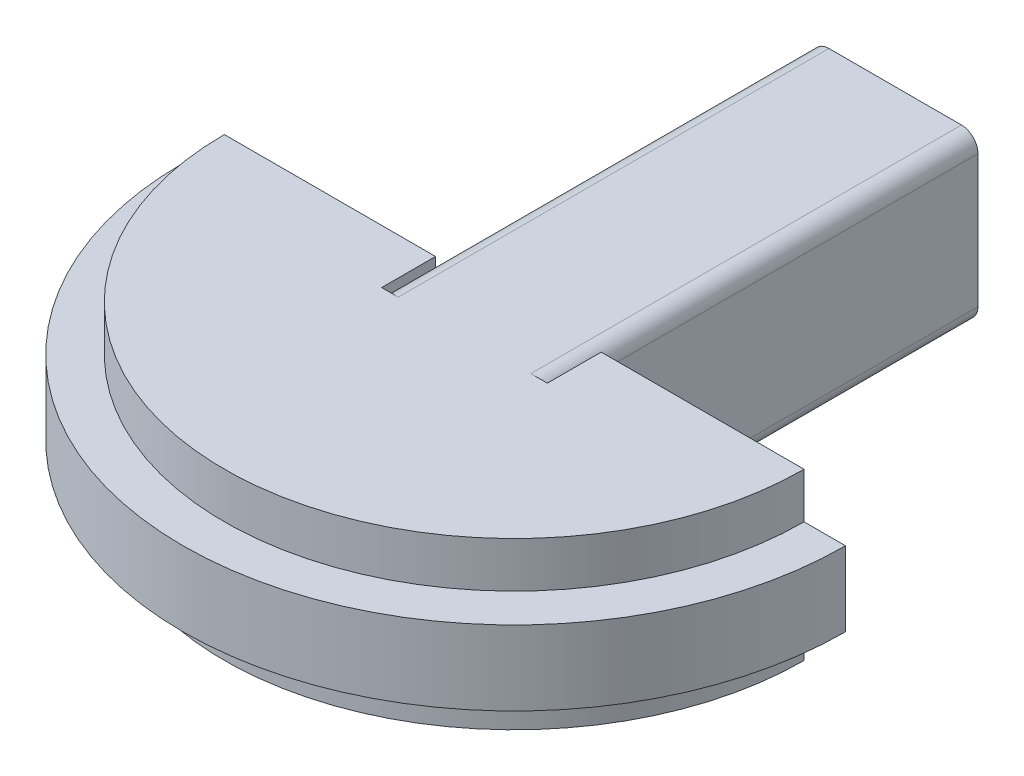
ISO-10303-21;
HEADER;
FILE_DESCRIPTION(('STEP AP214'),'2;1');
FILE_NAME('part.step','',(''),(''),'','','');
FILE_SCHEMA(('AUTOMOTIVE_DESIGN { 1 0 10303 214 1 1 1 1 }'));
ENDSEC;
DATA;
#1=APPLICATION_CONTEXT('core data for automotive mechanical design processes');
#2=APPLICATION_PROTOCOL_DEFINITION('international standard','automotive_design',2000,#1);
#3=PRODUCT_CONTEXT('',#1,'mechanical');
#4=PRODUCT('Part','Part','',(#3));
#5=PRODUCT_RELATED_PRODUCT_CATEGORY('part','',(#4));
#6=PRODUCT_DEFINITION_FORMATION('','',#4);
#7=PRODUCT_DEFINITION_CONTEXT('part definition',#1,'design');
#8=PRODUCT_DEFINITION('design','',#6,#7);
#9=PRODUCT_DEFINITION_SHAPE('','',#8);
#10=(LENGTH_UNIT() NAMED_UNIT(*) SI_UNIT(.MILLI.,.METRE.));
#11=(NAMED_UNIT(*) PLANE_ANGLE_UNIT() SI_UNIT($,.RADIAN.));
#12=(NAMED_UNIT(*) SI_UNIT($,.STERADIAN.) SOLID_ANGLE_UNIT());
#13=UNCERTAINTY_MEASURE_WITH_UNIT(LENGTH_MEASURE(1.E-05),#10,'distance_accuracy_value','');
#14=(GEOMETRIC_REPRESENTATION_CONTEXT(3) GLOBAL_UNCERTAINTY_ASSIGNED_CONTEXT((#13)) GLOBAL_UNIT_ASSIGNED_CONTEXT((#10,
#11,#12)) REPRESENTATION_CONTEXT('',''));
#15=CARTESIAN_POINT('',(0.,0.,0.));
#16=DIRECTION('',(0.,0.,1.));
#17=DIRECTION('',(1.,0.,0.));
#18=AXIS2_PLACEMENT_3D('',#15,#16,#17);
#19=CARTESIAN_POINT('',(-0.5,10.,45.5));
#20=DIRECTION('',(0.,-1.,0.));
#21=DIRECTION('',(0.,0.,1.));
#22=AXIS2_PLACEMENT_3D('',#19,#20,#21);
#23=CYLINDRICAL_SURFACE('',#22,35.);
#24=CARTESIAN_POINT('',(-0.5,-4.5,45.5));
#25=DIRECTION('',(0.,-1.,0.));
#26=DIRECTION('',(0.,0.,-1.));
#27=AXIS2_PLACEMENT_3D('',#24,#25,#26);
#28=CIRCLE('',#27,35.);
#29=CARTESIAN_POINT('',(34.5,-4.5,45.5));
#30=VERTEX_POINT('',#29);
#31=CARTESIAN_POINT('',(-35.5,-4.5,45.5));
#32=VERTEX_POINT('',#31);
#33=EDGE_CURVE('E29',#30,#32,#28,.T.);
#34=ORIENTED_EDGE('',*,*,#33,.T.);
#35=DIRECTION('',(0.,-1.,0.));
#36=VECTOR('',#35,1.);
#37=CARTESIAN_POINT('',(-35.5,10.,45.5));
#38=LINE('',#37,#36);
#39=CARTESIAN_POINT('',(-35.5,-10.,45.5));
#40=VERTEX_POINT('',#39);
#41=EDGE_CURVE('E259',#32,#40,#38,.T.);
#42=ORIENTED_EDGE('',*,*,#41,.T.);
#43=CARTESIAN_POINT('',(-0.5,-10.,45.5));
#44=DIRECTION('',(0.,1.,0.));
#45=DIRECTION('',(0.,0.,-1.));
#46=AXIS2_PLACEMENT_3D('',#43,#44,#45);
#47=CIRCLE('',#46,35.);
#48=CARTESIAN_POINT('',(34.5,-10.,45.5));
#49=VERTEX_POINT('',#48);
#50=EDGE_CURVE('E232',#40,#49,#47,.T.);
#51=ORIENTED_EDGE('',*,*,#50,.T.);
#52=DIRECTION('',(0.,-1.,0.));
#53=VECTOR('',#52,1.);
#54=CARTESIAN_POINT('',(34.5,10.,45.5));
#55=LINE('',#54,#53);
#56=EDGE_CURVE('E255',#30,#49,#55,.T.);
#57=ORIENTED_EDGE('',*,*,#56,.F.);
#58=EDGE_LOOP('',(#34,#42,#51,#57));
#59=FACE_BOUND('',#58,.T.);
#60=ADVANCED_FACE('F14',(#59),#23,.T.);
#61=CARTESIAN_POINT('',(10.,-10.,52.));
#62=DIRECTION('',(-1.,0.,0.));
#63=DIRECTION('',(0.,0.,1.));
#64=AXIS2_PLACEMENT_3D('',#61,#62,#63);
#65=PLANE('',#64);
#66=DIRECTION('',(0.,-1.,0.));
#67=VECTOR('',#66,1.);
#68=CARTESIAN_POINT('',(10.,10.,45.5));
#69=LINE('',#68,#67);
#70=CARTESIAN_POINT('',(10.,8.,45.5));
#71=VERTEX_POINT('',#70);
#72=CARTESIAN_POINT('',(10.,-8.,45.5));
#73=VERTEX_POINT('',#72);
#74=EDGE_CURVE('E37',#71,#73,#69,.T.);
#75=ORIENTED_EDGE('',*,*,#74,.T.);
#76=DIRECTION('',(0.,0.,-1.));
#77=VECTOR('',#76,1.);
#78=CARTESIAN_POINT('',(10.,-8.,52.));
#79=LINE('',#78,#77);
#80=CARTESIAN_POINT('',(10.,-8.,0.));
#81=VERTEX_POINT('',#80);
#82=EDGE_CURVE('E157',#73,#81,#79,.T.);
#83=ORIENTED_EDGE('',*,*,#82,.T.);
#84=DIRECTION('',(0.,-1.,0.));
#85=VECTOR('',#84,1.);
#86=CARTESIAN_POINT('',(10.,8.,0.));
#87=LINE('',#86,#85);
#88=CARTESIAN_POINT('',(10.,8.,0.));
#89=VERTEX_POINT('',#88);
#90=EDGE_CURVE('E160',#89,#81,#87,.T.);
#91=ORIENTED_EDGE('',*,*,#90,.F.);
#92=DIRECTION('',(0.,0.,-1.));
#93=VECTOR('',#92,1.);
#94=CARTESIAN_POINT('',(10.,8.,52.));
#95=LINE('',#94,#93);
#96=EDGE_CURVE('E151',#89,#71,#95,.F.);
#97=ORIENTED_EDGE('',*,*,#96,.T.);
#98=EDGE_LOOP('',(#75,#83,#91,#97));
#99=FACE_BOUND('',#98,.T.);
#100=ADVANCED_FACE('F161',(#99),#65,.F.);
#101=CARTESIAN_POINT('',(-10.,-10.,52.));
#102=DIRECTION('',(1.,0.,0.));
#103=DIRECTION('',(0.,0.,-1.));
#104=AXIS2_PLACEMENT_3D('',#101,#102,#103);
#105=PLANE('',#104);
#106=DIRECTION('',(0.,-1.,0.));
#107=VECTOR('',#106,1.);
#108=CARTESIAN_POINT('',(-10.,10.,45.5));
#109=LINE('',#108,#107);
#110=CARTESIAN_POINT('',(-10.,8.,45.5));
#111=VERTEX_POINT('',#110);
#112=CARTESIAN_POINT('',(-10.,-8.,45.5));
#113=VERTEX_POINT('',#112);
#114=EDGE_CURVE('E268',#111,#113,#109,.T.);
#115=ORIENTED_EDGE('',*,*,#114,.F.);
#116=DIRECTION('',(0.,0.,-1.));
#117=VECTOR('',#116,1.);
#118=CARTESIAN_POINT('',(-10.,8.,52.));
#119=LINE('',#118,#117);
#120=CARTESIAN_POINT('',(-10.,8.,0.));
#121=VERTEX_POINT('',#120);
#122=EDGE_CURVE('E290',#111,#121,#119,.T.);
#123=ORIENTED_EDGE('',*,*,#122,.T.);
#124=DIRECTION('',(0.,1.,0.));
#125=VECTOR('',#124,1.);
#126=CARTESIAN_POINT('',(-10.,-8.,0.));
#127=LINE('',#126,#125);
#128=CARTESIAN_POINT('',(-10.,-8.,0.));
#129=VERTEX_POINT('',#128);
#130=EDGE_CURVE('E181',#129,#121,#127,.T.);
#131=ORIENTED_EDGE('',*,*,#130,.F.);
#132=DIRECTION('',(0.,0.,-1.));
#133=VECTOR('',#132,1.);
#134=CARTESIAN_POINT('',(-10.,-8.,52.));
#135=LINE('',#134,#133);
#136=EDGE_CURVE('E294',#129,#113,#135,.F.);
#137=ORIENTED_EDGE('',*,*,#136,.T.);
#138=EDGE_LOOP('',(#115,#123,#131,#137));
#139=FACE_BOUND('',#138,.T.);
#140=ADVANCED_FACE('F341',(#139),#105,.F.);
#141=CARTESIAN_POINT('',(10.,10.,52.));
#142=DIRECTION('',(0.,-1.,0.));
#143=DIRECTION('',(0.,0.,1.));
#144=AXIS2_PLACEMENT_3D('',#141,#142,#143);
#145=PLANE('',#144);
#146=DIRECTION('',(0.,0.,-1.));
#147=VECTOR('',#146,1.);
#148=CARTESIAN_POINT('',(8.,10.,52.));
#149=LINE('',#148,#147);
#150=CARTESIAN_POINT('',(8.,10.,52.));
#151=VERTEX_POINT('',#150);
#152=CARTESIAN_POINT('',(8.,10.,0.));
#153=VERTEX_POINT('',#152);
#154=EDGE_CURVE('E22',#151,#153,#149,.T.);
#155=ORIENTED_EDGE('',*,*,#154,.T.);
#156=DIRECTION('',(1.,0.,0.));
#157=VECTOR('',#156,1.);
#158=CARTESIAN_POINT('',(-8.,10.,0.));
#159=LINE('',#158,#157);
#160=CARTESIAN_POINT('',(-8.,10.,0.));
#161=VERTEX_POINT('',#160);
#162=EDGE_CURVE('E171',#161,#153,#159,.T.);
#163=ORIENTED_EDGE('',*,*,#162,.F.);
#164=DIRECTION('',(0.,0.,-1.));
#165=VECTOR('',#164,1.);
#166=CARTESIAN_POINT('',(-8.,10.,52.));
#167=LINE('',#166,#165);
#168=CARTESIAN_POINT('',(-8.,10.,52.));
#169=VERTEX_POINT('',#168);
#170=EDGE_CURVE('E9',#161,#169,#167,.F.);
#171=ORIENTED_EDGE('',*,*,#170,.T.);
#172=DIRECTION('',(-1.,0.,0.));
#173=VECTOR('',#172,1.);
#174=CARTESIAN_POINT('',(10.,10.,52.));
#175=LINE('',#174,#173);
#176=CARTESIAN_POINT('',(-10.,10.,52.));
#177=VERTEX_POINT('',#176);
#178=EDGE_CURVE('E222',#169,#177,#175,.T.);
#179=ORIENTED_EDGE('',*,*,#178,.T.);
#180=DIRECTION('',(0.,0.,-1.));
#181=VECTOR('',#180,1.);
#182=CARTESIAN_POINT('',(-10.,10.,52.));
#183=LINE('',#182,#181);
#184=CARTESIAN_POINT('',(-10.,10.,45.5));
#185=VERTEX_POINT('',#184);
#186=EDGE_CURVE('E210',#177,#185,#183,.T.);
#187=ORIENTED_EDGE('',*,*,#186,.T.);
#188=DIRECTION('',(-1.,0.,0.));
#189=VECTOR('',#188,1.);
#190=CARTESIAN_POINT('',(-10.,10.,45.5));
#191=LINE('',#190,#189);
#192=CARTESIAN_POINT('',(-35.5,10.,45.5));
#193=VERTEX_POINT('',#192);
#194=EDGE_CURVE('E213',#185,#193,#191,.T.);
#195=ORIENTED_EDGE('',*,*,#194,.T.);
#196=CARTESIAN_POINT('',(-0.5,10.,45.5));
#197=DIRECTION('',(0.,1.,0.));
#198=DIRECTION('',(0.,0.,-1.));
#199=AXIS2_PLACEMENT_3D('',#196,#197,#198);
#200=CIRCLE('',#199,35.);
#201=CARTESIAN_POINT('',(34.5,10.,45.5));
#202=VERTEX_POINT('',#201);
#203=EDGE_CURVE('E216',#193,#202,#200,.T.);
#204=ORIENTED_EDGE('',*,*,#203,.T.);
#205=DIRECTION('',(-1.,0.,0.));
#206=VECTOR('',#205,1.);
#207=CARTESIAN_POINT('',(10.,10.,45.5));
#208=LINE('',#207,#206);
#209=CARTESIAN_POINT('',(10.,10.,45.5));
#210=VERTEX_POINT('',#209);
#211=EDGE_CURVE('E218',#202,#210,#208,.T.);
#212=ORIENTED_EDGE('',*,*,#211,.T.);
#213=DIRECTION('',(0.,0.,1.));
#214=VECTOR('',#213,1.);
#215=CARTESIAN_POINT('',(10.,10.,52.));
#216=LINE('',#215,#214);
#217=CARTESIAN_POINT('',(10.,10.,52.));
#218=VERTEX_POINT('',#217);
#219=EDGE_CURVE('E220',#210,#218,#216,.T.);
#220=ORIENTED_EDGE('',*,*,#219,.T.);
#221=EDGE_CURVE('E223',#218,#151,#175,.T.);
#222=ORIENTED_EDGE('',*,*,#221,.T.);
#223=EDGE_LOOP('',(#155,#163,#171,#179,#187,#195,#204,#212,#220,#222));
#224=FACE_BOUND('',#223,.T.);
#225=ADVANCED_FACE('F297',(#224),#145,.F.);
#226=CARTESIAN_POINT('',(10.,-10.,52.));
#227=DIRECTION('',(0.,1.,0.));
#228=DIRECTION('',(1.,0.,0.));
#229=AXIS2_PLACEMENT_3D('',#226,#227,#228);
#230=PLANE('',#229);
#231=DIRECTION('',(0.,0.,-1.));
#232=VECTOR('',#231,1.);
#233=CARTESIAN_POINT('',(-8.,-10.,52.));
#234=LINE('',#233,#232);
#235=CARTESIAN_POINT('',(-8.,-10.,52.));
#236=VERTEX_POINT('',#235);
#237=CARTESIAN_POINT('',(-8.,-10.,0.));
#238=VERTEX_POINT('',#237);
#239=EDGE_CURVE('E274',#236,#238,#234,.T.);
#240=ORIENTED_EDGE('',*,*,#239,.T.);
#241=DIRECTION('',(-1.,0.,0.));
#242=VECTOR('',#241,1.);
#243=CARTESIAN_POINT('',(8.,-10.,0.));
#244=LINE('',#243,#242);
#245=CARTESIAN_POINT('',(8.,-10.,0.));
#246=VERTEX_POINT('',#245);
#247=EDGE_CURVE('E175',#246,#238,#244,.T.);
#248=ORIENTED_EDGE('',*,*,#247,.F.);
#249=DIRECTION('',(0.,0.,-1.));
#250=VECTOR('',#249,1.);
#251=CARTESIAN_POINT('',(8.,-10.,52.));
#252=LINE('',#251,#250);
#253=CARTESIAN_POINT('',(8.,-10.,52.));
#254=VERTEX_POINT('',#253);
#255=EDGE_CURVE('E276',#246,#254,#252,.F.);
#256=ORIENTED_EDGE('',*,*,#255,.T.);
#257=DIRECTION('',(-1.,0.,0.));
#258=VECTOR('',#257,1.);
#259=CARTESIAN_POINT('',(10.,-10.,52.));
#260=LINE('',#259,#258);
#261=CARTESIAN_POINT('',(10.,-10.,52.));
#262=VERTEX_POINT('',#261);
#263=EDGE_CURVE('E214',#262,#254,#260,.T.);
#264=ORIENTED_EDGE('',*,*,#263,.F.);
#265=DIRECTION('',(0.,0.,1.));
#266=VECTOR('',#265,1.);
#267=CARTESIAN_POINT('',(10.,-10.,52.));
#268=LINE('',#267,#266);
#269=CARTESIAN_POINT('',(10.,-10.,45.5));
#270=VERTEX_POINT('',#269);
#271=EDGE_CURVE('E238',#270,#262,#268,.T.);
#272=ORIENTED_EDGE('',*,*,#271,.F.);
#273=DIRECTION('',(-1.,0.,0.));
#274=VECTOR('',#273,1.);
#275=CARTESIAN_POINT('',(10.,-10.,45.5));
#276=LINE('',#275,#274);
#277=EDGE_CURVE('E235',#49,#270,#276,.T.);
#278=ORIENTED_EDGE('',*,*,#277,.F.);
#279=ORIENTED_EDGE('',*,*,#50,.F.);
#280=DIRECTION('',(-1.,0.,0.));
#281=VECTOR('',#280,1.);
#282=CARTESIAN_POINT('',(-10.,-10.,45.5));
#283=LINE('',#282,#281);
#284=CARTESIAN_POINT('',(-10.,-10.,45.5));
#285=VERTEX_POINT('',#284);
#286=EDGE_CURVE('E229',#285,#40,#283,.T.);
#287=ORIENTED_EDGE('',*,*,#286,.F.);
#288=DIRECTION('',(0.,0.,-1.));
#289=VECTOR('',#288,1.);
#290=CARTESIAN_POINT('',(-10.,-10.,52.));
#291=LINE('',#290,#289);
#292=CARTESIAN_POINT('',(-10.,-10.,52.));
#293=VERTEX_POINT('',#292);
#294=EDGE_CURVE('E209',#293,#285,#291,.T.);
#295=ORIENTED_EDGE('',*,*,#294,.F.);
#296=EDGE_CURVE('E241',#236,#293,#260,.T.);
#297=ORIENTED_EDGE('',*,*,#296,.F.);
#298=EDGE_LOOP('',(#240,#248,#256,#264,#272,#278,#279,#287,#295,#297));
#299=FACE_BOUND('',#298,.T.);
#300=ADVANCED_FACE('F319',(#299),#230,.F.);
#301=CARTESIAN_POINT('',(8.,-8.,52.));
#302=DIRECTION('',(0.,0.,-1.));
#303=DIRECTION('',(-1.,0.,0.));
#304=AXIS2_PLACEMENT_3D('',#301,#302,#303);
#305=CYLINDRICAL_SURFACE('',#304,2.);
#306=CARTESIAN_POINT('',(8.,-8.,52.));
#307=DIRECTION('',(0.,0.,1.));
#308=DIRECTION('',(1.,0.,0.));
#309=AXIS2_PLACEMENT_3D('',#306,#307,#308);
#310=CIRCLE('',#309,2.);
#311=CARTESIAN_POINT('',(10.,-8.,52.));
#312=VERTEX_POINT('',#311);
#313=EDGE_CURVE('E287',#254,#312,#310,.T.);
#314=ORIENTED_EDGE('',*,*,#313,.F.);
#315=ORIENTED_EDGE('',*,*,#255,.F.);
#316=CARTESIAN_POINT('',(8.,-8.,0.));
#317=DIRECTION('',(0.,0.,-1.));
#318=DIRECTION('',(-1.,0.,0.));
#319=AXIS2_PLACEMENT_3D('',#316,#317,#318);
#320=CIRCLE('',#319,2.);
#321=EDGE_CURVE('E165',#81,#246,#320,.T.);
#322=ORIENTED_EDGE('',*,*,#321,.F.);
#323=ORIENTED_EDGE('',*,*,#82,.F.);
#324=EDGE_CURVE('E271',#312,#73,#79,.T.);
#325=ORIENTED_EDGE('',*,*,#324,.F.);
#326=EDGE_LOOP('',(#314,#315,#322,#323,#325));
#327=FACE_BOUND('',#326,.T.);
#328=ADVANCED_FACE('F325',(#327),#305,.T.);
#329=CARTESIAN_POINT('',(-8.,-8.,52.));
#330=DIRECTION('',(0.,0.,-1.));
#331=DIRECTION('',(-1.,0.,0.));
#332=AXIS2_PLACEMENT_3D('',#329,#330,#331);
#333=CYLINDRICAL_SURFACE('',#332,2.);
#334=CARTESIAN_POINT('',(-8.,-8.,52.));
#335=DIRECTION('',(0.,0.,1.));
#336=DIRECTION('',(1.,0.,0.));
#337=AXIS2_PLACEMENT_3D('',#334,#335,#336);
#338=CIRCLE('',#337,2.);
#339=CARTESIAN_POINT('',(-10.,-8.,52.));
#340=VERTEX_POINT('',#339);
#341=EDGE_CURVE('E284',#340,#236,#338,.T.);
#342=ORIENTED_EDGE('',*,*,#341,.F.);
#343=DIRECTION('',(0.,0.,-1.));
#344=VECTOR('',#343,1.);
#345=CARTESIAN_POINT('',(-10.,-8.,52.));
#346=LINE('',#345,#344);
#347=EDGE_CURVE('E267',#113,#340,#346,.F.);
#348=ORIENTED_EDGE('',*,*,#347,.F.);
#349=ORIENTED_EDGE('',*,*,#136,.F.);
#350=CARTESIAN_POINT('',(-8.,-8.,0.));
#351=DIRECTION('',(0.,0.,-1.));
#352=DIRECTION('',(-1.,0.,0.));
#353=AXIS2_PLACEMENT_3D('',#350,#351,#352);
#354=CIRCLE('',#353,2.);
#355=EDGE_CURVE('E178',#238,#129,#354,.T.);
#356=ORIENTED_EDGE('',*,*,#355,.F.);
#357=ORIENTED_EDGE('',*,*,#239,.F.);
#358=EDGE_LOOP('',(#342,#348,#349,#356,#357));
#359=FACE_BOUND('',#358,.T.);
#360=ADVANCED_FACE('F331',(#359),#333,.T.);
#361=CARTESIAN_POINT('',(-8.,8.,52.));
#362=DIRECTION('',(0.,0.,-1.));
#363=DIRECTION('',(-1.,0.,0.));
#364=AXIS2_PLACEMENT_3D('',#361,#362,#363);
#365=CYLINDRICAL_SURFACE('',#364,2.);
#366=CARTESIAN_POINT('',(-8.,8.,52.));
#367=DIRECTION('',(0.,0.,1.));
#368=DIRECTION('',(1.,0.,0.));
#369=AXIS2_PLACEMENT_3D('',#366,#367,#368);
#370=CIRCLE('',#369,2.);
#371=CARTESIAN_POINT('',(-10.,8.,52.));
#372=VERTEX_POINT('',#371);
#373=EDGE_CURVE('E281',#169,#372,#370,.T.);
#374=ORIENTED_EDGE('',*,*,#373,.F.);
#375=ORIENTED_EDGE('',*,*,#170,.F.);
#376=CARTESIAN_POINT('',(-8.,8.,0.));
#377=DIRECTION('',(0.,0.,-1.));
#378=DIRECTION('',(-1.,0.,0.));
#379=AXIS2_PLACEMENT_3D('',#376,#377,#378);
#380=CIRCLE('',#379,2.);
#381=EDGE_CURVE('E184',#121,#161,#380,.T.);
#382=ORIENTED_EDGE('',*,*,#381,.F.);
#383=ORIENTED_EDGE('',*,*,#122,.F.);
#384=EDGE_CURVE('E291',#372,#111,#119,.T.);
#385=ORIENTED_EDGE('',*,*,#384,.F.);
#386=EDGE_LOOP('',(#374,#375,#382,#383,#385));
#387=FACE_BOUND('',#386,.T.);
#388=ADVANCED_FACE('F346',(#387),#365,.T.);
#389=CARTESIAN_POINT('',(8.,8.,52.));
#390=DIRECTION('',(0.,0.,-1.));
#391=DIRECTION('',(-1.,0.,0.));
#392=AXIS2_PLACEMENT_3D('',#389,#390,#391);
#393=CYLINDRICAL_SURFACE('',#392,2.);
#394=CARTESIAN_POINT('',(8.,8.,52.));
#395=DIRECTION('',(0.,0.,1.));
#396=DIRECTION('',(1.,0.,0.));
#397=AXIS2_PLACEMENT_3D('',#394,#395,#396);
#398=CIRCLE('',#397,2.);
#399=CARTESIAN_POINT('',(10.,8.,52.));
#400=VERTEX_POINT('',#399);
#401=EDGE_CURVE('E278',#400,#151,#398,.T.);
#402=ORIENTED_EDGE('',*,*,#401,.F.);
#403=EDGE_CURVE('E156',#71,#400,#95,.F.);
#404=ORIENTED_EDGE('',*,*,#403,.F.);
#405=ORIENTED_EDGE('',*,*,#96,.F.);
#406=CARTESIAN_POINT('',(8.,8.,0.));
#407=DIRECTION('',(0.,0.,-1.));
#408=DIRECTION('',(-1.,0.,0.));
#409=AXIS2_PLACEMENT_3D('',#406,#407,#408);
#410=CIRCLE('',#409,2.);
#411=EDGE_CURVE('E154',#153,#89,#410,.T.);
#412=ORIENTED_EDGE('',*,*,#411,.F.);
#413=ORIENTED_EDGE('',*,*,#154,.F.);
#414=EDGE_LOOP('',(#402,#404,#405,#412,#413));
#415=FACE_BOUND('',#414,.T.);
#416=ADVANCED_FACE('F16',(#415),#393,.T.);
#417=CARTESIAN_POINT('',(-10.,10.,52.));
#418=DIRECTION('',(-1.,0.,0.));
#419=DIRECTION('',(0.,0.,1.));
#420=AXIS2_PLACEMENT_3D('',#417,#418,#419);
#421=PLANE('',#420);
#422=EDGE_CURVE('E263',#113,#285,#109,.T.);
#423=ORIENTED_EDGE('',*,*,#422,.F.);
#424=ORIENTED_EDGE('',*,*,#347,.T.);
#425=DIRECTION('',(0.,-1.,0.));
#426=VECTOR('',#425,1.);
#427=CARTESIAN_POINT('',(-10.,10.,52.));
#428=LINE('',#427,#426);
#429=EDGE_CURVE('E226',#340,#293,#428,.T.);
#430=ORIENTED_EDGE('',*,*,#429,.T.);
#431=ORIENTED_EDGE('',*,*,#294,.T.);
#432=EDGE_LOOP('',(#423,#424,#430,#431));
#433=FACE_BOUND('',#432,.T.);
#434=ADVANCED_FACE('F337',(#433),#421,.F.);
#435=CARTESIAN_POINT('',(10.,10.,52.));
#436=DIRECTION('',(1.,0.,0.));
#437=DIRECTION('',(0.,0.,-1.));
#438=AXIS2_PLACEMENT_3D('',#435,#436,#437);
#439=PLANE('',#438);
#440=EDGE_CURVE('E252',#210,#71,#69,.T.);
#441=ORIENTED_EDGE('',*,*,#440,.T.);
#442=ORIENTED_EDGE('',*,*,#403,.T.);
#443=DIRECTION('',(0.,-1.,0.));
#444=VECTOR('',#443,1.);
#445=CARTESIAN_POINT('',(10.,10.,52.));
#446=LINE('',#445,#444);
#447=EDGE_CURVE('E248',#218,#400,#446,.T.);
#448=ORIENTED_EDGE('',*,*,#447,.F.);
#449=ORIENTED_EDGE('',*,*,#219,.F.);
#450=EDGE_LOOP('',(#441,#442,#448,#449));
#451=FACE_BOUND('',#450,.T.);
#452=ADVANCED_FACE('F304',(#451),#439,.F.);
#453=CARTESIAN_POINT('',(10.,10.,52.));
#454=DIRECTION('',(0.,0.,1.));
#455=DIRECTION('',(1.,0.,0.));
#456=AXIS2_PLACEMENT_3D('',#453,#454,#455);
#457=PLANE('',#456);
#458=ORIENTED_EDGE('',*,*,#313,.T.);
#459=EDGE_CURVE('E247',#312,#262,#446,.T.);
#460=ORIENTED_EDGE('',*,*,#459,.T.);
#461=ORIENTED_EDGE('',*,*,#263,.T.);
#462=EDGE_LOOP('',(#458,#460,#461));
#463=FACE_BOUND('',#462,.T.);
#464=ADVANCED_FACE('F323',(#463),#457,.F.);
#465=ORIENTED_EDGE('',*,*,#341,.T.);
#466=ORIENTED_EDGE('',*,*,#296,.T.);
#467=ORIENTED_EDGE('',*,*,#429,.F.);
#468=EDGE_LOOP('',(#465,#466,#467));
#469=FACE_BOUND('',#468,.T.);
#470=ADVANCED_FACE('F334',(#469),#457,.F.);
#471=ORIENTED_EDGE('',*,*,#373,.T.);
#472=EDGE_CURVE('E244',#177,#372,#428,.T.);
#473=ORIENTED_EDGE('',*,*,#472,.F.);
#474=ORIENTED_EDGE('',*,*,#178,.F.);
#475=EDGE_LOOP('',(#471,#473,#474));
#476=FACE_BOUND('',#475,.T.);
#477=ADVANCED_FACE('F352',(#476),#457,.F.);
#478=ORIENTED_EDGE('',*,*,#384,.T.);
#479=EDGE_CURVE('E264',#185,#111,#109,.T.);
#480=ORIENTED_EDGE('',*,*,#479,.F.);
#481=ORIENTED_EDGE('',*,*,#186,.F.);
#482=ORIENTED_EDGE('',*,*,#472,.T.);
#483=EDGE_LOOP('',(#478,#480,#481,#482));
#484=FACE_BOUND('',#483,.T.);
#485=ADVANCED_FACE('F354',(#484),#421,.F.);
#486=CARTESIAN_POINT('',(-10.,10.,45.5));
#487=DIRECTION('',(0.,0.,1.));
#488=DIRECTION('',(1.,0.,0.));
#489=AXIS2_PLACEMENT_3D('',#486,#487,#488);
#490=PLANE('',#489);
#491=ORIENTED_EDGE('',*,*,#286,.T.);
#492=ORIENTED_EDGE('',*,*,#41,.F.);
#493=DIRECTION('',(-1.,0.,0.));
#494=VECTOR('',#493,1.);
#495=CARTESIAN_POINT('',(-35.5,-4.5,45.5));
#496=LINE('',#495,#494);
#497=CARTESIAN_POINT('',(-40.5,-4.5,45.5));
#498=VERTEX_POINT('',#497);
#499=EDGE_CURVE('E199',#32,#498,#496,.T.);
#500=ORIENTED_EDGE('',*,*,#499,.T.);
#501=DIRECTION('',(0.,-1.,0.));
#502=VECTOR('',#501,1.);
#503=CARTESIAN_POINT('',(-40.5,4.5,45.5));
#504=LINE('',#503,#502);
#505=CARTESIAN_POINT('',(-40.5,4.5,45.5));
#506=VERTEX_POINT('',#505);
#507=EDGE_CURVE('E206',#506,#498,#504,.T.);
#508=ORIENTED_EDGE('',*,*,#507,.F.);
#509=DIRECTION('',(-1.,0.,0.));
#510=VECTOR('',#509,1.);
#511=CARTESIAN_POINT('',(-35.5,4.5,45.5));
#512=LINE('',#511,#510);
#513=CARTESIAN_POINT('',(-35.5,4.5,45.5));
#514=VERTEX_POINT('',#513);
#515=EDGE_CURVE('E190',#514,#506,#512,.T.);
#516=ORIENTED_EDGE('',*,*,#515,.F.);
#517=EDGE_CURVE('E260',#193,#514,#38,.T.);
#518=ORIENTED_EDGE('',*,*,#517,.F.);
#519=ORIENTED_EDGE('',*,*,#194,.F.);
#520=ORIENTED_EDGE('',*,*,#479,.T.);
#521=ORIENTED_EDGE('',*,*,#114,.T.);
#522=ORIENTED_EDGE('',*,*,#422,.T.);
#523=EDGE_LOOP('',(#491,#492,#500,#508,#516,#518,#519,#520,#521,#522));
#524=FACE_BOUND('',#523,.T.);
#525=ADVANCED_FACE('F356',(#524),#490,.F.);
#526=ORIENTED_EDGE('',*,*,#517,.T.);
#527=CARTESIAN_POINT('',(-0.5,4.5,45.5));
#528=DIRECTION('',(0.,-1.,0.));
#529=DIRECTION('',(0.,0.,-1.));
#530=AXIS2_PLACEMENT_3D('',#527,#528,#529);
#531=CIRCLE('',#530,35.);
#532=CARTESIAN_POINT('',(34.5,4.5,45.5));
#533=VERTEX_POINT('',#532);
#534=EDGE_CURVE('E187',#533,#514,#531,.T.);
#535=ORIENTED_EDGE('',*,*,#534,.F.);
#536=EDGE_CURVE('E256',#202,#533,#55,.T.);
#537=ORIENTED_EDGE('',*,*,#536,.F.);
#538=ORIENTED_EDGE('',*,*,#203,.F.);
#539=EDGE_LOOP('',(#526,#535,#537,#538));
#540=FACE_BOUND('',#539,.T.);
#541=ADVANCED_FACE('F362',(#540),#23,.T.);
#542=CARTESIAN_POINT('',(10.,10.,45.5));
#543=DIRECTION('',(0.,0.,1.));
#544=DIRECTION('',(1.,0.,0.));
#545=AXIS2_PLACEMENT_3D('',#542,#543,#544);
#546=PLANE('',#545);
#547=ORIENTED_EDGE('',*,*,#277,.T.);
#548=EDGE_CURVE('E251',#73,#270,#69,.T.);
#549=ORIENTED_EDGE('',*,*,#548,.F.);
#550=ORIENTED_EDGE('',*,*,#74,.F.);
#551=ORIENTED_EDGE('',*,*,#440,.F.);
#552=ORIENTED_EDGE('',*,*,#211,.F.);
#553=ORIENTED_EDGE('',*,*,#536,.T.);
#554=DIRECTION('',(-1.,0.,0.));
#555=VECTOR('',#554,1.);
#556=CARTESIAN_POINT('',(34.5,4.5,45.5));
#557=LINE('',#556,#555);
#558=CARTESIAN_POINT('',(39.5,4.5,45.5));
#559=VERTEX_POINT('',#558);
#560=EDGE_CURVE('E195',#559,#533,#557,.T.);
#561=ORIENTED_EDGE('',*,*,#560,.F.);
#562=DIRECTION('',(0.,-1.,0.));
#563=VECTOR('',#562,1.);
#564=CARTESIAN_POINT('',(39.5,4.5,45.5));
#565=LINE('',#564,#563);
#566=CARTESIAN_POINT('',(39.5,-4.5,45.5));
#567=VERTEX_POINT('',#566);
#568=EDGE_CURVE('E197',#559,#567,#565,.T.);
#569=ORIENTED_EDGE('',*,*,#568,.T.);
#570=DIRECTION('',(-1.,0.,0.));
#571=VECTOR('',#570,1.);
#572=CARTESIAN_POINT('',(34.5,-4.5,45.5));
#573=LINE('',#572,#571);
#574=EDGE_CURVE('E191',#567,#30,#573,.T.);
#575=ORIENTED_EDGE('',*,*,#574,.T.);
#576=ORIENTED_EDGE('',*,*,#56,.T.);
#577=EDGE_LOOP('',(#547,#549,#550,#551,#552,#553,#561,#569,#575,#576));
#578=FACE_BOUND('',#577,.T.);
#579=ADVANCED_FACE('F308',(#578),#546,.F.);
#580=ORIENTED_EDGE('',*,*,#324,.T.);
#581=ORIENTED_EDGE('',*,*,#548,.T.);
#582=ORIENTED_EDGE('',*,*,#271,.T.);
#583=ORIENTED_EDGE('',*,*,#459,.F.);
#584=EDGE_LOOP('',(#580,#581,#582,#583));
#585=FACE_BOUND('',#584,.T.);
#586=ADVANCED_FACE('F311',(#585),#439,.F.);
#587=ORIENTED_EDGE('',*,*,#401,.T.);
#588=ORIENTED_EDGE('',*,*,#221,.F.);
#589=ORIENTED_EDGE('',*,*,#447,.T.);
#590=EDGE_LOOP('',(#587,#588,#589));
#591=FACE_BOUND('',#590,.T.);
#592=ADVANCED_FACE('F300',(#591),#457,.F.);
#593=CARTESIAN_POINT('',(-0.5,4.5,45.5));
#594=DIRECTION('',(0.,-1.,0.));
#595=DIRECTION('',(0.,0.,1.));
#596=AXIS2_PLACEMENT_3D('',#593,#594,#595);
#597=CYLINDRICAL_SURFACE('',#596,40.);
#598=CARTESIAN_POINT('',(-0.5,-4.5,45.5));
#599=DIRECTION('',(0.,1.,0.));
#600=DIRECTION('',(0.,0.,-1.));
#601=AXIS2_PLACEMENT_3D('',#598,#599,#600);
#602=CIRCLE('',#601,40.);
#603=EDGE_CURVE('E201',#498,#567,#602,.T.);
#604=ORIENTED_EDGE('',*,*,#603,.T.);
#605=ORIENTED_EDGE('',*,*,#568,.F.);
#606=CARTESIAN_POINT('',(-0.5,4.5,45.5));
#607=DIRECTION('',(0.,1.,0.));
#608=DIRECTION('',(0.,0.,-1.));
#609=AXIS2_PLACEMENT_3D('',#606,#607,#608);
#610=CIRCLE('',#609,40.);
#611=EDGE_CURVE('E193',#506,#559,#610,.T.);
#612=ORIENTED_EDGE('',*,*,#611,.F.);
#613=ORIENTED_EDGE('',*,*,#507,.T.);
#614=EDGE_LOOP('',(#604,#605,#612,#613));
#615=FACE_BOUND('',#614,.T.);
#616=ADVANCED_FACE('F370',(#615),#597,.T.);
#617=CARTESIAN_POINT('',(-0.5,4.5,45.5));
#618=DIRECTION('',(0.,1.,0.));
#619=DIRECTION('',(0.,0.,-1.));
#620=AXIS2_PLACEMENT_3D('',#617,#618,#619);
#621=PLANE('',#620);
#622=ORIENTED_EDGE('',*,*,#534,.T.);
#623=ORIENTED_EDGE('',*,*,#515,.T.);
#624=ORIENTED_EDGE('',*,*,#611,.T.);
#625=ORIENTED_EDGE('',*,*,#560,.T.);
#626=EDGE_LOOP('',(#622,#623,#624,#625));
#627=FACE_BOUND('',#626,.T.);
#628=ADVANCED_FACE('F366',(#627),#621,.T.);
#629=CARTESIAN_POINT('',(-0.5,-4.5,45.5));
#630=DIRECTION('',(0.,1.,0.));
#631=DIRECTION('',(0.,0.,-1.));
#632=AXIS2_PLACEMENT_3D('',#629,#630,#631);
#633=PLANE('',#632);
#634=ORIENTED_EDGE('',*,*,#33,.F.);
#635=ORIENTED_EDGE('',*,*,#574,.F.);
#636=ORIENTED_EDGE('',*,*,#603,.F.);
#637=ORIENTED_EDGE('',*,*,#499,.F.);
#638=EDGE_LOOP('',(#634,#635,#636,#637));
#639=FACE_BOUND('',#638,.T.);
#640=ADVANCED_FACE('F372',(#639),#633,.F.);
#641=CARTESIAN_POINT('',(8.,8.,0.));
#642=DIRECTION('',(0.,0.,-1.));
#643=DIRECTION('',(-1.,0.,0.));
#644=AXIS2_PLACEMENT_3D('',#641,#642,#643);
#645=PLANE('',#644);
#646=ORIENTED_EDGE('',*,*,#411,.T.);
#647=ORIENTED_EDGE('',*,*,#90,.T.);
#648=ORIENTED_EDGE('',*,*,#321,.T.);
#649=ORIENTED_EDGE('',*,*,#247,.T.);
#650=ORIENTED_EDGE('',*,*,#355,.T.);
#651=ORIENTED_EDGE('',*,*,#130,.T.);
#652=ORIENTED_EDGE('',*,*,#381,.T.);
#653=ORIENTED_EDGE('',*,*,#162,.T.);
#654=EDGE_LOOP('',(#646,#647,#648,#649,#650,#651,#652,#653));
#655=FACE_BOUND('',#654,.T.);
#656=ADVANCED_FACE('F168',(#655),#645,.T.);
#657=CLOSED_SHELL('',(#60,#100,#140,#225,#300,#328,#360,#388,#416,#434,#452,#464,#470,#477,#485,
#525,#541,#579,#586,#592,#616,#628,#640,#656));
#658=MANIFOLD_SOLID_BREP('B1',#657);
#659=ADVANCED_BREP_SHAPE_REPRESENTATION('',(#18,#658),#14);
#660=SHAPE_DEFINITION_REPRESENTATION(#9,#659);
ENDSEC;
END-ISO-10303-21;
